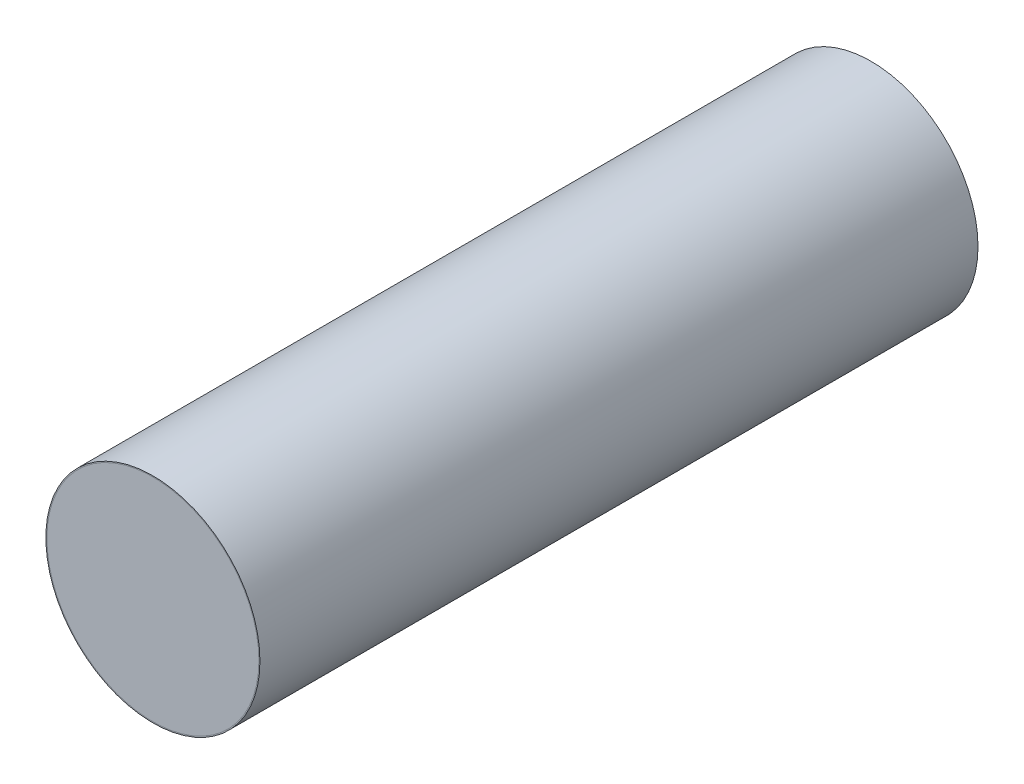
ISO-10303-21;
HEADER;
FILE_DESCRIPTION(('STEP AP214'),'2;1');
FILE_NAME('part.step','',(''),(''),'','','');
FILE_SCHEMA(('AUTOMOTIVE_DESIGN { 1 0 10303 214 1 1 1 1 }'));
ENDSEC;
DATA;
#1=APPLICATION_CONTEXT('core data for automotive mechanical design processes');
#2=APPLICATION_PROTOCOL_DEFINITION('international standard','automotive_design',2000,#1);
#3=PRODUCT_CONTEXT('',#1,'mechanical');
#4=PRODUCT('Part','Part','',(#3));
#5=PRODUCT_RELATED_PRODUCT_CATEGORY('part','',(#4));
#6=PRODUCT_DEFINITION_FORMATION('','',#4);
#7=PRODUCT_DEFINITION_CONTEXT('part definition',#1,'design');
#8=PRODUCT_DEFINITION('design','',#6,#7);
#9=PRODUCT_DEFINITION_SHAPE('','',#8);
#10=(LENGTH_UNIT() NAMED_UNIT(*) SI_UNIT(.MILLI.,.METRE.));
#11=(NAMED_UNIT(*) PLANE_ANGLE_UNIT() SI_UNIT($,.RADIAN.));
#12=(NAMED_UNIT(*) SI_UNIT($,.STERADIAN.) SOLID_ANGLE_UNIT());
#13=UNCERTAINTY_MEASURE_WITH_UNIT(LENGTH_MEASURE(1.E-05),#10,'distance_accuracy_value','');
#14=(GEOMETRIC_REPRESENTATION_CONTEXT(3) GLOBAL_UNCERTAINTY_ASSIGNED_CONTEXT((#13)) GLOBAL_UNIT_ASSIGNED_CONTEXT((#10,
#11,#12)) REPRESENTATION_CONTEXT('',''));
#15=CARTESIAN_POINT('',(0.,0.,0.));
#16=DIRECTION('',(0.,0.,1.));
#17=DIRECTION('',(1.,0.,0.));
#18=AXIS2_PLACEMENT_3D('',#15,#16,#17);
#19=CARTESIAN_POINT('',(0.,0.,67.5));
#20=DIRECTION('',(0.,0.,1.));
#21=DIRECTION('',(1.,0.,0.));
#22=AXIS2_PLACEMENT_3D('',#19,#20,#21);
#23=PLANE('',#22);
#24=CARTESIAN_POINT('',(0.,0.,67.5));
#25=DIRECTION('',(0.,0.,1.));
#26=DIRECTION('',(1.,0.,0.));
#27=AXIS2_PLACEMENT_3D('',#24,#25,#26);
#28=CIRCLE('',#27,10.13);
#29=CARTESIAN_POINT('',(10.13,0.,67.5));
#30=VERTEX_POINT('',#29);
#31=EDGE_CURVE('E11',#30,#30,#28,.T.);
#32=ORIENTED_EDGE('',*,*,#31,.T.);
#33=EDGE_LOOP('',(#32));
#34=FACE_BOUND('',#33,.T.);
#35=CARTESIAN_POINT('',(0.,0.,67.5));
#36=DIRECTION('',(0.,0.,1.));
#37=DIRECTION('',(1.,0.,0.));
#38=AXIS2_PLACEMENT_3D('',#35,#36,#37);
#39=CIRCLE('',#38,10.03);
#40=CARTESIAN_POINT('',(10.03,0.,67.5));
#41=VERTEX_POINT('',#40);
#42=EDGE_CURVE('E64',#41,#41,#39,.T.);
#43=ORIENTED_EDGE('',*,*,#42,.F.);
#44=EDGE_LOOP('',(#43));
#45=FACE_BOUND('',#44,.T.);
#46=ADVANCED_FACE('F53',(#34,#45),#23,.T.);
#47=CARTESIAN_POINT('',(0.,0.,2.5));
#48=DIRECTION('',(0.,0.,1.));
#49=DIRECTION('',(1.,0.,0.));
#50=AXIS2_PLACEMENT_3D('',#47,#48,#49);
#51=PLANE('',#50);
#52=CARTESIAN_POINT('',(0.,0.,2.5));
#53=DIRECTION('',(0.,0.,1.));
#54=DIRECTION('',(1.,0.,0.));
#55=AXIS2_PLACEMENT_3D('',#52,#53,#54);
#56=CIRCLE('',#55,10.13);
#57=CARTESIAN_POINT('',(10.13,0.,2.5));
#58=VERTEX_POINT('',#57);
#59=EDGE_CURVE('E59',#58,#58,#56,.T.);
#60=ORIENTED_EDGE('',*,*,#59,.F.);
#61=EDGE_LOOP('',(#60));
#62=FACE_BOUND('',#61,.T.);
#63=CARTESIAN_POINT('',(0.,0.,2.5));
#64=DIRECTION('',(0.,0.,1.));
#65=DIRECTION('',(1.,0.,0.));
#66=AXIS2_PLACEMENT_3D('',#63,#64,#65);
#67=CIRCLE('',#66,10.03);
#68=CARTESIAN_POINT('',(10.03,0.,2.5));
#69=VERTEX_POINT('',#68);
#70=EDGE_CURVE('E70',#69,#69,#67,.T.);
#71=ORIENTED_EDGE('',*,*,#70,.T.);
#72=EDGE_LOOP('',(#71));
#73=FACE_BOUND('',#72,.T.);
#74=ADVANCED_FACE('F80',(#62,#73),#51,.F.);
#75=CARTESIAN_POINT('',(0.,0.,67.5));
#76=DIRECTION('',(0.,0.,-1.));
#77=DIRECTION('',(-1.,0.,0.));
#78=AXIS2_PLACEMENT_3D('',#75,#76,#77);
#79=CYLINDRICAL_SURFACE('',#78,10.13);
#80=ORIENTED_EDGE('',*,*,#31,.F.);
#81=EDGE_LOOP('',(#80));
#82=FACE_BOUND('',#81,.T.);
#83=ORIENTED_EDGE('',*,*,#59,.T.);
#84=EDGE_LOOP('',(#83));
#85=FACE_BOUND('',#84,.T.);
#86=ADVANCED_FACE('F57',(#82,#85),#79,.T.);
#87=CARTESIAN_POINT('',(0.,0.,67.5));
#88=DIRECTION('',(0.,0.,-1.));
#89=DIRECTION('',(-1.,0.,0.));
#90=AXIS2_PLACEMENT_3D('',#87,#88,#89);
#91=CYLINDRICAL_SURFACE('',#90,10.03);
#92=ORIENTED_EDGE('',*,*,#42,.T.);
#93=EDGE_LOOP('',(#92));
#94=FACE_BOUND('',#93,.T.);
#95=ORIENTED_EDGE('',*,*,#70,.F.);
#96=EDGE_LOOP('',(#95));
#97=FACE_BOUND('',#96,.T.);
#98=ADVANCED_FACE('F71',(#94,#97),#91,.F.);
#99=CLOSED_SHELL('',(#46,#74,#86,#98));
#100=MANIFOLD_SOLID_BREP('B2',#99);
#101=CARTESIAN_POINT('',(0.,0.,67.5));
#102=DIRECTION('',(0.,0.,1.));
#103=DIRECTION('',(1.,0.,0.));
#104=AXIS2_PLACEMENT_3D('',#101,#102,#103);
#105=PLANE('',#104);
#106=CARTESIAN_POINT('',(0.,0.,67.5));
#107=DIRECTION('',(0.,0.,1.));
#108=DIRECTION('',(1.,0.,0.));
#109=AXIS2_PLACEMENT_3D('',#106,#107,#108);
#110=CIRCLE('',#109,10.03);
#111=CARTESIAN_POINT('',(10.03,0.,67.5));
#112=VERTEX_POINT('',#111);
#113=EDGE_CURVE('E52',#112,#112,#110,.T.);
#114=ORIENTED_EDGE('',*,*,#113,.T.);
#115=EDGE_LOOP('',(#114));
#116=FACE_BOUND('',#115,.T.);
#117=CARTESIAN_POINT('',(0.,0.,67.5));
#118=DIRECTION('',(0.,0.,1.));
#119=DIRECTION('',(1.,0.,0.));
#120=AXIS2_PLACEMENT_3D('',#117,#118,#119);
#121=CIRCLE('',#120,1.5);
#122=CARTESIAN_POINT('',(1.5,0.,67.5));
#123=VERTEX_POINT('',#122);
#124=EDGE_CURVE('E134',#123,#123,#121,.T.);
#125=ORIENTED_EDGE('',*,*,#124,.F.);
#126=EDGE_LOOP('',(#125));
#127=FACE_BOUND('',#126,.T.);
#128=ADVANCED_FACE('F122',(#116,#127),#105,.T.);
#129=CARTESIAN_POINT('',(0.,0.,2.5));
#130=DIRECTION('',(0.,0.,1.));
#131=DIRECTION('',(1.,0.,0.));
#132=AXIS2_PLACEMENT_3D('',#129,#130,#131);
#133=PLANE('',#132);
#134=CARTESIAN_POINT('',(0.,0.,2.5));
#135=DIRECTION('',(0.,0.,1.));
#136=DIRECTION('',(1.,0.,0.));
#137=AXIS2_PLACEMENT_3D('',#134,#135,#136);
#138=CIRCLE('',#137,10.03);
#139=CARTESIAN_POINT('',(10.03,0.,2.5));
#140=VERTEX_POINT('',#139);
#141=EDGE_CURVE('E126',#140,#140,#138,.T.);
#142=ORIENTED_EDGE('',*,*,#141,.F.);
#143=EDGE_LOOP('',(#142));
#144=FACE_BOUND('',#143,.T.);
#145=CARTESIAN_POINT('',(0.,0.,2.5));
#146=DIRECTION('',(0.,0.,1.));
#147=DIRECTION('',(1.,0.,0.));
#148=AXIS2_PLACEMENT_3D('',#145,#146,#147);
#149=CIRCLE('',#148,1.5);
#150=CARTESIAN_POINT('',(1.5,0.,2.5));
#151=VERTEX_POINT('',#150);
#152=EDGE_CURVE('E140',#151,#151,#149,.T.);
#153=ORIENTED_EDGE('',*,*,#152,.T.);
#154=EDGE_LOOP('',(#153));
#155=FACE_BOUND('',#154,.T.);
#156=ADVANCED_FACE('F150',(#144,#155),#133,.F.);
#157=CARTESIAN_POINT('',(0.,0.,67.5));
#158=DIRECTION('',(0.,0.,-1.));
#159=DIRECTION('',(-1.,0.,0.));
#160=AXIS2_PLACEMENT_3D('',#157,#158,#159);
#161=CYLINDRICAL_SURFACE('',#160,10.03);
#162=ORIENTED_EDGE('',*,*,#113,.F.);
#163=EDGE_LOOP('',(#162));
#164=FACE_BOUND('',#163,.T.);
#165=ORIENTED_EDGE('',*,*,#141,.T.);
#166=EDGE_LOOP('',(#165));
#167=FACE_BOUND('',#166,.T.);
#168=ADVANCED_FACE('F127',(#164,#167),#161,.T.);
#169=CARTESIAN_POINT('',(0.,0.,67.5));
#170=DIRECTION('',(0.,0.,-1.));
#171=DIRECTION('',(-1.,0.,0.));
#172=AXIS2_PLACEMENT_3D('',#169,#170,#171);
#173=CYLINDRICAL_SURFACE('',#172,1.5);
#174=ORIENTED_EDGE('',*,*,#124,.T.);
#175=EDGE_LOOP('',(#174));
#176=FACE_BOUND('',#175,.T.);
#177=ORIENTED_EDGE('',*,*,#152,.F.);
#178=EDGE_LOOP('',(#177));
#179=FACE_BOUND('',#178,.T.);
#180=ADVANCED_FACE('F141',(#176,#179),#173,.F.);
#181=CLOSED_SHELL('',(#128,#156,#168,#180));
#182=MANIFOLD_SOLID_BREP('B6',#181);
#183=CARTESIAN_POINT('',(0.,0.,69.3));
#184=DIRECTION('',(0.,0.,-1.));
#185=DIRECTION('',(-1.,0.,0.));
#186=AXIS2_PLACEMENT_3D('',#183,#184,#185);
#187=CYLINDRICAL_SURFACE('',#186,10.13);
#188=CARTESIAN_POINT('',(0.,0.,69.3));
#189=DIRECTION('',(0.,0.,1.));
#190=DIRECTION('',(1.,0.,0.));
#191=AXIS2_PLACEMENT_3D('',#188,#189,#190);
#192=CIRCLE('',#191,10.13);
#193=CARTESIAN_POINT('',(10.13,0.,69.3));
#194=VERTEX_POINT('',#193);
#195=EDGE_CURVE('E123',#194,#194,#192,.T.);
#196=ORIENTED_EDGE('',*,*,#195,.F.);
#197=EDGE_LOOP('',(#196));
#198=FACE_BOUND('',#197,.T.);
#199=CARTESIAN_POINT('',(0.,0.,67.5));
#200=DIRECTION('',(0.,0.,1.));
#201=DIRECTION('',(1.,0.,0.));
#202=AXIS2_PLACEMENT_3D('',#199,#200,#201);
#203=CIRCLE('',#202,10.13);
#204=CARTESIAN_POINT('',(10.13,0.,67.5));
#205=VERTEX_POINT('',#204);
#206=EDGE_CURVE('E197',#205,#205,#203,.T.);
#207=ORIENTED_EDGE('',*,*,#206,.T.);
#208=EDGE_LOOP('',(#207));
#209=FACE_BOUND('',#208,.T.);
#210=ADVANCED_FACE('F192',(#198,#209),#187,.T.);
#211=CARTESIAN_POINT('',(0.,0.,69.3));
#212=DIRECTION('',(0.,0.,1.));
#213=DIRECTION('',(1.,0.,0.));
#214=AXIS2_PLACEMENT_3D('',#211,#212,#213);
#215=PLANE('',#214);
#216=ORIENTED_EDGE('',*,*,#195,.T.);
#217=EDGE_LOOP('',(#216));
#218=FACE_BOUND('',#217,.T.);
#219=ADVANCED_FACE('F207',(#218),#215,.T.);
#220=CARTESIAN_POINT('',(0.,0.,67.5));
#221=DIRECTION('',(0.,0.,1.));
#222=DIRECTION('',(1.,0.,0.));
#223=AXIS2_PLACEMENT_3D('',#220,#221,#222);
#224=PLANE('',#223);
#225=ORIENTED_EDGE('',*,*,#206,.F.);
#226=EDGE_LOOP('',(#225));
#227=FACE_BOUND('',#226,.T.);
#228=ADVANCED_FACE('F210',(#227),#224,.F.);
#229=CLOSED_SHELL('',(#210,#219,#228));
#230=MANIFOLD_SOLID_BREP('B48',#229);
#231=CARTESIAN_POINT('',(0.,0.,2.5));
#232=DIRECTION('',(0.,0.,-1.));
#233=DIRECTION('',(-1.,0.,0.));
#234=AXIS2_PLACEMENT_3D('',#231,#232,#233);
#235=CYLINDRICAL_SURFACE('',#234,10.13);
#236=CARTESIAN_POINT('',(0.,0.,2.5));
#237=DIRECTION('',(0.,0.,1.));
#238=DIRECTION('',(1.,0.,0.));
#239=AXIS2_PLACEMENT_3D('',#236,#237,#238);
#240=CIRCLE('',#239,10.13);
#241=CARTESIAN_POINT('',(10.13,0.,2.5));
#242=VERTEX_POINT('',#241);
#243=EDGE_CURVE('E193',#242,#242,#240,.T.);
#244=ORIENTED_EDGE('',*,*,#243,.F.);
#245=EDGE_LOOP('',(#244));
#246=FACE_BOUND('',#245,.T.);
#247=CARTESIAN_POINT('',(0.,0.,0.3));
#248=DIRECTION('',(0.,0.,1.));
#249=DIRECTION('',(1.,0.,0.));
#250=AXIS2_PLACEMENT_3D('',#247,#248,#249);
#251=CIRCLE('',#250,10.13);
#252=CARTESIAN_POINT('',(10.13,0.,0.3));
#253=VERTEX_POINT('',#252);
#254=EDGE_CURVE('E246',#253,#253,#251,.T.);
#255=ORIENTED_EDGE('',*,*,#254,.T.);
#256=EDGE_LOOP('',(#255));
#257=FACE_BOUND('',#256,.T.);
#258=ADVANCED_FACE('F242',(#246,#257),#235,.T.);
#259=CARTESIAN_POINT('',(0.,0.,2.5));
#260=DIRECTION('',(0.,0.,1.));
#261=DIRECTION('',(1.,0.,0.));
#262=AXIS2_PLACEMENT_3D('',#259,#260,#261);
#263=PLANE('',#262);
#264=ORIENTED_EDGE('',*,*,#243,.T.);
#265=EDGE_LOOP('',(#264));
#266=FACE_BOUND('',#265,.T.);
#267=ADVANCED_FACE('F256',(#266),#263,.T.);
#268=CARTESIAN_POINT('',(0.,0.,0.3));
#269=DIRECTION('',(0.,0.,1.));
#270=DIRECTION('',(1.,0.,0.));
#271=AXIS2_PLACEMENT_3D('',#268,#269,#270);
#272=PLANE('',#271);
#273=ORIENTED_EDGE('',*,*,#254,.F.);
#274=EDGE_LOOP('',(#273));
#275=FACE_BOUND('',#274,.T.);
#276=ADVANCED_FACE('F258',(#275),#272,.F.);
#277=CLOSED_SHELL('',(#258,#267,#276));
#278=MANIFOLD_SOLID_BREP('B117',#277);
#279=CARTESIAN_POINT('',(0.,0.,70.1));
#280=DIRECTION('',(0.,0.,1.));
#281=DIRECTION('',(1.,0.,0.));
#282=AXIS2_PLACEMENT_3D('',#279,#280,#281);
#283=PLANE('',#282);
#284=CARTESIAN_POINT('',(0.,0.,70.1));
#285=DIRECTION('',(0.,0.,1.));
#286=DIRECTION('',(1.,0.,0.));
#287=AXIS2_PLACEMENT_3D('',#284,#285,#286);
#288=CIRCLE('',#287,10.45);
#289=CARTESIAN_POINT('',(10.45,0.,70.1));
#290=VERTEX_POINT('',#289);
#291=EDGE_CURVE('E245',#290,#290,#288,.T.);
#292=ORIENTED_EDGE('',*,*,#291,.T.);
#293=EDGE_LOOP('',(#292));
#294=FACE_BOUND('',#293,.T.);
#295=CARTESIAN_POINT('',(0.,0.,70.1));
#296=DIRECTION('',(0.,0.,1.));
#297=DIRECTION('',(1.,0.,0.));
#298=AXIS2_PLACEMENT_3D('',#295,#296,#297);
#299=CIRCLE('',#298,10.35);
#300=CARTESIAN_POINT('',(10.35,0.,70.1));
#301=VERTEX_POINT('',#300);
#302=EDGE_CURVE('E303',#301,#301,#299,.T.);
#303=ORIENTED_EDGE('',*,*,#302,.F.);
#304=EDGE_LOOP('',(#303));
#305=FACE_BOUND('',#304,.T.);
#306=ADVANCED_FACE('F295',(#294,#305),#283,.T.);
#307=CARTESIAN_POINT('',(0.,0.,0.));
#308=DIRECTION('',(0.,0.,1.));
#309=DIRECTION('',(1.,0.,0.));
#310=AXIS2_PLACEMENT_3D('',#307,#308,#309);
#311=PLANE('',#310);
#312=CARTESIAN_POINT('',(0.,0.,0.));
#313=DIRECTION('',(0.,0.,1.));
#314=DIRECTION('',(1.,0.,0.));
#315=AXIS2_PLACEMENT_3D('',#312,#313,#314);
#316=CIRCLE('',#315,10.45);
#317=CARTESIAN_POINT('',(10.45,0.,0.));
#318=VERTEX_POINT('',#317);
#319=EDGE_CURVE('E296',#318,#318,#316,.T.);
#320=ORIENTED_EDGE('',*,*,#319,.F.);
#321=EDGE_LOOP('',(#320));
#322=FACE_BOUND('',#321,.T.);
#323=CARTESIAN_POINT('',(0.,0.,0.));
#324=DIRECTION('',(0.,0.,1.));
#325=DIRECTION('',(1.,0.,0.));
#326=AXIS2_PLACEMENT_3D('',#323,#324,#325);
#327=CIRCLE('',#326,10.35);
#328=CARTESIAN_POINT('',(10.35,0.,0.));
#329=VERTEX_POINT('',#328);
#330=EDGE_CURVE('E304',#329,#329,#327,.T.);
#331=ORIENTED_EDGE('',*,*,#330,.T.);
#332=EDGE_LOOP('',(#331));
#333=FACE_BOUND('',#332,.T.);
#334=ADVANCED_FACE('F312',(#322,#333),#311,.F.);
#335=CARTESIAN_POINT('',(0.,0.,70.1));
#336=DIRECTION('',(0.,0.,-1.));
#337=DIRECTION('',(-1.,0.,0.));
#338=AXIS2_PLACEMENT_3D('',#335,#336,#337);
#339=CYLINDRICAL_SURFACE('',#338,10.45);
#340=ORIENTED_EDGE('',*,*,#291,.F.);
#341=EDGE_LOOP('',(#340));
#342=FACE_BOUND('',#341,.T.);
#343=ORIENTED_EDGE('',*,*,#319,.T.);
#344=EDGE_LOOP('',(#343));
#345=FACE_BOUND('',#344,.T.);
#346=ADVANCED_FACE('F294',(#342,#345),#339,.T.);
#347=CARTESIAN_POINT('',(0.,0.,70.1));
#348=DIRECTION('',(0.,0.,-1.));
#349=DIRECTION('',(-1.,0.,0.));
#350=AXIS2_PLACEMENT_3D('',#347,#348,#349);
#351=CYLINDRICAL_SURFACE('',#350,10.35);
#352=ORIENTED_EDGE('',*,*,#302,.T.);
#353=EDGE_LOOP('',(#352));
#354=FACE_BOUND('',#353,.T.);
#355=ORIENTED_EDGE('',*,*,#330,.F.);
#356=EDGE_LOOP('',(#355));
#357=FACE_BOUND('',#356,.T.);
#358=ADVANCED_FACE('F313',(#354,#357),#351,.F.);
#359=CLOSED_SHELL('',(#306,#334,#346,#358));
#360=MANIFOLD_SOLID_BREP('B187',#359);
#361=CARTESIAN_POINT('',(0.,0.,70.1));
#362=DIRECTION('',(0.,0.,-1.));
#363=DIRECTION('',(-1.,0.,0.));
#364=AXIS2_PLACEMENT_3D('',#361,#362,#363);
#365=CYLINDRICAL_SURFACE('',#364,10.35);
#366=CARTESIAN_POINT('',(0.,0.,70.1));
#367=DIRECTION('',(0.,0.,1.));
#368=DIRECTION('',(1.,0.,0.));
#369=AXIS2_PLACEMENT_3D('',#366,#367,#368);
#370=CIRCLE('',#369,10.35);
#371=CARTESIAN_POINT('',(10.35,0.,70.1));
#372=VERTEX_POINT('',#371);
#373=EDGE_CURVE('E292',#372,#372,#370,.T.);
#374=ORIENTED_EDGE('',*,*,#373,.F.);
#375=EDGE_LOOP('',(#374));
#376=FACE_BOUND('',#375,.T.);
#377=CARTESIAN_POINT('',(0.,0.,69.3));
#378=DIRECTION('',(0.,0.,1.));
#379=DIRECTION('',(1.,0.,0.));
#380=AXIS2_PLACEMENT_3D('',#377,#378,#379);
#381=CIRCLE('',#380,10.35);
#382=CARTESIAN_POINT('',(10.35,0.,69.3));
#383=VERTEX_POINT('',#382);
#384=EDGE_CURVE('E365',#383,#383,#381,.T.);
#385=ORIENTED_EDGE('',*,*,#384,.T.);
#386=EDGE_LOOP('',(#385));
#387=FACE_BOUND('',#386,.T.);
#388=ADVANCED_FACE('F363',(#376,#387),#365,.T.);
#389=CARTESIAN_POINT('',(0.,0.,70.1));
#390=DIRECTION('',(0.,0.,1.));
#391=DIRECTION('',(1.,0.,0.));
#392=AXIS2_PLACEMENT_3D('',#389,#390,#391);
#393=PLANE('',#392);
#394=ORIENTED_EDGE('',*,*,#373,.T.);
#395=EDGE_LOOP('',(#394));
#396=FACE_BOUND('',#395,.T.);
#397=ADVANCED_FACE('F376',(#396),#393,.T.);
#398=CARTESIAN_POINT('',(0.,0.,69.3));
#399=DIRECTION('',(0.,0.,1.));
#400=DIRECTION('',(1.,0.,0.));
#401=AXIS2_PLACEMENT_3D('',#398,#399,#400);
#402=PLANE('',#401);
#403=ORIENTED_EDGE('',*,*,#384,.F.);
#404=EDGE_LOOP('',(#403));
#405=FACE_BOUND('',#404,.T.);
#406=ADVANCED_FACE('F372',(#405),#402,.F.);
#407=CLOSED_SHELL('',(#388,#397,#406));
#408=MANIFOLD_SOLID_BREP('B240',#407);
#409=CARTESIAN_POINT('',(0.,0.,0.3));
#410=DIRECTION('',(0.,0.,-1.));
#411=DIRECTION('',(-1.,0.,0.));
#412=AXIS2_PLACEMENT_3D('',#409,#410,#411);
#413=CYLINDRICAL_SURFACE('',#412,10.35);
#414=CARTESIAN_POINT('',(0.,0.,0.));
#415=DIRECTION('',(0.,0.,1.));
#416=DIRECTION('',(1.,0.,0.));
#417=AXIS2_PLACEMENT_3D('',#414,#415,#416);
#418=CIRCLE('',#417,10.35);
#419=CARTESIAN_POINT('',(10.35,0.,0.));
#420=VERTEX_POINT('',#419);
#421=EDGE_CURVE('E359',#420,#420,#418,.T.);
#422=ORIENTED_EDGE('',*,*,#421,.T.);
#423=EDGE_LOOP('',(#422));
#424=FACE_BOUND('',#423,.T.);
#425=CARTESIAN_POINT('',(0.,0.,69.3));
#426=DIRECTION('',(0.,0.,1.));
#427=DIRECTION('',(1.,0.,0.));
#428=AXIS2_PLACEMENT_3D('',#425,#426,#427);
#429=CIRCLE('',#428,10.35);
#430=CARTESIAN_POINT('',(10.35,0.,69.3));
#431=VERTEX_POINT('',#430);
#432=EDGE_CURVE('E407',#431,#431,#429,.T.);
#433=ORIENTED_EDGE('',*,*,#432,.F.);
#434=EDGE_LOOP('',(#433));
#435=FACE_BOUND('',#434,.T.);
#436=ADVANCED_FACE('F405',(#424,#435),#413,.T.);
#437=CARTESIAN_POINT('',(0.,0.,0.));
#438=DIRECTION('',(0.,0.,1.));
#439=DIRECTION('',(1.,0.,0.));
#440=AXIS2_PLACEMENT_3D('',#437,#438,#439);
#441=PLANE('',#440);
#442=ORIENTED_EDGE('',*,*,#421,.F.);
#443=EDGE_LOOP('',(#442));
#444=FACE_BOUND('',#443,.T.);
#445=ADVANCED_FACE('F432',(#444),#441,.F.);
#446=CARTESIAN_POINT('',(0.,0.,69.3));
#447=DIRECTION('',(0.,0.,1.));
#448=DIRECTION('',(1.,0.,0.));
#449=AXIS2_PLACEMENT_3D('',#446,#447,#448);
#450=PLANE('',#449);
#451=ORIENTED_EDGE('',*,*,#432,.T.);
#452=EDGE_LOOP('',(#451));
#453=FACE_BOUND('',#452,.T.);
#454=CARTESIAN_POINT('',(0.,0.,69.3));
#455=DIRECTION('',(0.,0.,1.));
#456=DIRECTION('',(1.,0.,0.));
#457=AXIS2_PLACEMENT_3D('',#454,#455,#456);
#458=CIRCLE('',#457,10.13);
#459=CARTESIAN_POINT('',(10.13,0.,69.3));
#460=VERTEX_POINT('',#459);
#461=EDGE_CURVE('E415',#460,#460,#458,.T.);
#462=ORIENTED_EDGE('',*,*,#461,.F.);
#463=EDGE_LOOP('',(#462));
#464=FACE_BOUND('',#463,.T.);
#465=ADVANCED_FACE('F426',(#453,#464),#450,.T.);
#466=CARTESIAN_POINT('',(0.,0.,69.3));
#467=DIRECTION('',(0.,0.,-1.));
#468=DIRECTION('',(-1.,0.,0.));
#469=AXIS2_PLACEMENT_3D('',#466,#467,#468);
#470=CYLINDRICAL_SURFACE('',#469,10.13);
#471=ORIENTED_EDGE('',*,*,#461,.T.);
#472=EDGE_LOOP('',(#471));
#473=FACE_BOUND('',#472,.T.);
#474=CARTESIAN_POINT('',(0.,0.,0.3));
#475=DIRECTION('',(0.,0.,1.));
#476=DIRECTION('',(1.,0.,0.));
#477=AXIS2_PLACEMENT_3D('',#474,#475,#476);
#478=CIRCLE('',#477,10.13);
#479=CARTESIAN_POINT('',(10.13,0.,0.3));
#480=VERTEX_POINT('',#479);
#481=EDGE_CURVE('E418',#480,#480,#478,.T.);
#482=ORIENTED_EDGE('',*,*,#481,.F.);
#483=EDGE_LOOP('',(#482));
#484=FACE_BOUND('',#483,.T.);
#485=ADVANCED_FACE('F424',(#473,#484),#470,.F.);
#486=CARTESIAN_POINT('',(0.,0.,0.3));
#487=DIRECTION('',(0.,0.,1.));
#488=DIRECTION('',(1.,0.,0.));
#489=AXIS2_PLACEMENT_3D('',#486,#487,#488);
#490=PLANE('',#489);
#491=ORIENTED_EDGE('',*,*,#481,.T.);
#492=EDGE_LOOP('',(#491));
#493=FACE_BOUND('',#492,.T.);
#494=ADVANCED_FACE('F425',(#493),#490,.T.);
#495=CLOSED_SHELL('',(#436,#445,#465,#485,#494));
#496=MANIFOLD_SOLID_BREP('B286',#495);
#497=ADVANCED_BREP_SHAPE_REPRESENTATION('',(#18,#100,#182,#230,#278,#360,#408,#496),#14);
#498=SHAPE_DEFINITION_REPRESENTATION(#9,#497);
ENDSEC;
END-ISO-10303-21;
